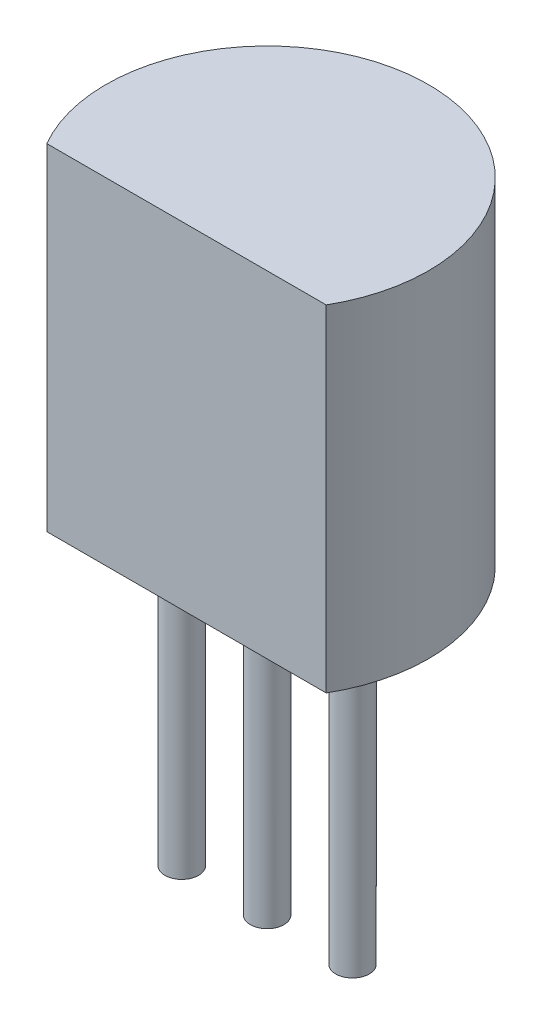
from build123d import *

# Parameters (mm, degrees)
EXTRUSION1_DEPTH   = 5
ESQUISSE6_R        = 0.25
BOSS_EXTRU_1_DEPTH = 4.5


with BuildPart() as part:
    # Esquisse2 → Extrusion1 (new body)
    with BuildSketch(Plane(origin=(0, 0, 0), x_dir=(1, 0, 0), z_dir=(0, 1, 0))):
        with BuildLine():
            Line((-2.078460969, -1.2), (2.078460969, -1.2))
            ThreePointArc((2.078460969, -1.2), (0, 2.4), (-2.078460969, -1.2))
        make_face()
    extrude(amount=EXTRUSION1_DEPTH)

    # Esquisse6 → Boss.-Extru.1 (add)
    with BuildSketch(Plane.XZ):
        with Locations(Location((0, 0, 0), (0, 0, 90))):
            Circle(ESQUISSE6_R)
        with Locations(Location((1.27, 0, 0), (0, 0, 90))):
            Circle(ESQUISSE6_R)
        with Locations(Location((-1.27, 0, 0), (0, 0, 90))):
            Circle(ESQUISSE6_R)
    extrude(amount=BOSS_EXTRU_1_DEPTH)


solid = part.part
